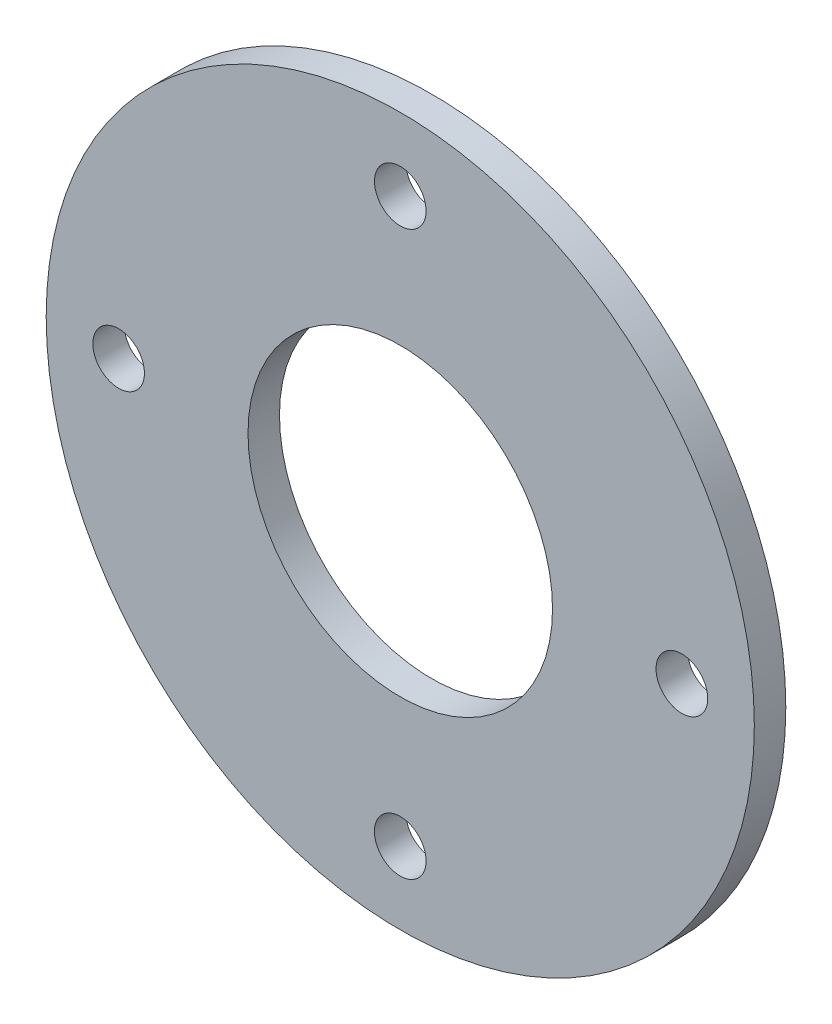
ISO-10303-21;
HEADER;
FILE_DESCRIPTION(('STEP AP214'),'2;1');
FILE_NAME('part.step','',(''),(''),'','','');
FILE_SCHEMA(('AUTOMOTIVE_DESIGN { 1 0 10303 214 1 1 1 1 }'));
ENDSEC;
DATA;
#1=APPLICATION_CONTEXT('core data for automotive mechanical design processes');
#2=APPLICATION_PROTOCOL_DEFINITION('international standard','automotive_design',2000,#1);
#3=PRODUCT_CONTEXT('',#1,'mechanical');
#4=PRODUCT('Part','Part','',(#3));
#5=PRODUCT_RELATED_PRODUCT_CATEGORY('part','',(#4));
#6=PRODUCT_DEFINITION_FORMATION('','',#4);
#7=PRODUCT_DEFINITION_CONTEXT('part definition',#1,'design');
#8=PRODUCT_DEFINITION('design','',#6,#7);
#9=PRODUCT_DEFINITION_SHAPE('','',#8);
#10=(LENGTH_UNIT() NAMED_UNIT(*) SI_UNIT(.MILLI.,.METRE.));
#11=(NAMED_UNIT(*) PLANE_ANGLE_UNIT() SI_UNIT($,.RADIAN.));
#12=(NAMED_UNIT(*) SI_UNIT($,.STERADIAN.) SOLID_ANGLE_UNIT());
#13=UNCERTAINTY_MEASURE_WITH_UNIT(LENGTH_MEASURE(1.E-05),#10,'distance_accuracy_value','');
#14=(GEOMETRIC_REPRESENTATION_CONTEXT(3) GLOBAL_UNCERTAINTY_ASSIGNED_CONTEXT((#13)) GLOBAL_UNIT_ASSIGNED_CONTEXT((#10,
#11,#12)) REPRESENTATION_CONTEXT('',''));
#15=CARTESIAN_POINT('',(0.,0.,0.));
#16=DIRECTION('',(0.,0.,1.));
#17=DIRECTION('',(1.,0.,0.));
#18=AXIS2_PLACEMENT_3D('',#15,#16,#17);
#19=CARTESIAN_POINT('',(0.,0.,10.16));
#20=DIRECTION('',(0.,0.,1.));
#21=DIRECTION('',(1.,0.,0.));
#22=AXIS2_PLACEMENT_3D('',#19,#20,#21);
#23=PLANE('',#22);
#24=CARTESIAN_POINT('',(0.,90.8527596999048,10.16));
#25=DIRECTION('',(0.,0.,-1.));
#26=DIRECTION('',(-1.,0.,0.));
#27=AXIS2_PLACEMENT_3D('',#24,#25,#26);
#28=CIRCLE('',#27,8.33374000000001);
#29=CARTESIAN_POINT('',(-8.33374000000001,90.8527596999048,10.16));
#30=VERTEX_POINT('',#29);
#31=EDGE_CURVE('E64',#30,#30,#28,.T.);
#32=ORIENTED_EDGE('',*,*,#31,.T.);
#33=EDGE_LOOP('',(#32));
#34=FACE_BOUND('',#33,.T.);
#35=CARTESIAN_POINT('',(-90.9113801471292,0.,10.16));
#36=DIRECTION('',(0.,0.,-1.));
#37=DIRECTION('',(-1.,0.,0.));
#38=AXIS2_PLACEMENT_3D('',#35,#36,#37);
#39=CIRCLE('',#38,8.33374000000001);
#40=CARTESIAN_POINT('',(-99.2451201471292,0.,10.16));
#41=VERTEX_POINT('',#40);
#42=EDGE_CURVE('E58',#41,#41,#39,.T.);
#43=ORIENTED_EDGE('',*,*,#42,.T.);
#44=EDGE_LOOP('',(#43));
#45=FACE_BOUND('',#44,.T.);
#46=CARTESIAN_POINT('',(0.,-90.9113801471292,10.16));
#47=DIRECTION('',(0.,0.,-1.));
#48=DIRECTION('',(-1.,0.,0.));
#49=AXIS2_PLACEMENT_3D('',#46,#47,#48);
#50=CIRCLE('',#49,8.33374000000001);
#51=CARTESIAN_POINT('',(-8.33374000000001,-90.9113801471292,10.16));
#52=VERTEX_POINT('',#51);
#53=EDGE_CURVE('E52',#52,#52,#50,.T.);
#54=ORIENTED_EDGE('',*,*,#53,.T.);
#55=EDGE_LOOP('',(#54));
#56=FACE_BOUND('',#55,.T.);
#57=CARTESIAN_POINT('',(90.9113801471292,0.,10.16));
#58=DIRECTION('',(0.,0.,-1.));
#59=DIRECTION('',(-1.,0.,0.));
#60=AXIS2_PLACEMENT_3D('',#57,#58,#59);
#61=CIRCLE('',#60,8.33374000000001);
#62=CARTESIAN_POINT('',(82.5776401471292,0.,10.16));
#63=VERTEX_POINT('',#62);
#64=EDGE_CURVE('E44',#63,#63,#61,.T.);
#65=ORIENTED_EDGE('',*,*,#64,.T.);
#66=EDGE_LOOP('',(#65));
#67=FACE_BOUND('',#66,.T.);
#68=CARTESIAN_POINT('',(0.,0.,10.16));
#69=DIRECTION('',(0.,0.,1.));
#70=DIRECTION('',(1.,0.,0.));
#71=AXIS2_PLACEMENT_3D('',#68,#69,#70);
#72=CIRCLE('',#71,114.3);
#73=CARTESIAN_POINT('',(114.3,0.,10.16));
#74=VERTEX_POINT('',#73);
#75=EDGE_CURVE('E10',#74,#74,#72,.T.);
#76=ORIENTED_EDGE('',*,*,#75,.T.);
#77=EDGE_LOOP('',(#76));
#78=FACE_BOUND('',#77,.T.);
#79=CARTESIAN_POINT('',(0.,0.,10.16));
#80=DIRECTION('',(0.,0.,1.));
#81=DIRECTION('',(1.,0.,0.));
#82=AXIS2_PLACEMENT_3D('',#79,#80,#81);
#83=CIRCLE('',#82,49.1499994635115);
#84=CARTESIAN_POINT('',(49.1499994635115,0.,10.16));
#85=VERTEX_POINT('',#84);
#86=EDGE_CURVE('E39',#85,#85,#83,.T.);
#87=ORIENTED_EDGE('',*,*,#86,.F.);
#88=EDGE_LOOP('',(#87));
#89=FACE_BOUND('',#88,.T.);
#90=ADVANCED_FACE('F28',(#34,#45,#56,#67,#78,#89),#23,.T.);
#91=CARTESIAN_POINT('',(0.,0.,0.));
#92=DIRECTION('',(0.,0.,1.));
#93=DIRECTION('',(1.,0.,0.));
#94=AXIS2_PLACEMENT_3D('',#91,#92,#93);
#95=PLANE('',#94);
#96=CARTESIAN_POINT('',(0.,90.8527596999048,0.));
#97=DIRECTION('',(0.,0.,-1.));
#98=DIRECTION('',(-1.,0.,0.));
#99=AXIS2_PLACEMENT_3D('',#96,#97,#98);
#100=CIRCLE('',#99,8.33374000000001);
#101=CARTESIAN_POINT('',(-8.33374000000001,90.8527596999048,0.));
#102=VERTEX_POINT('',#101);
#103=EDGE_CURVE('E67',#102,#102,#100,.T.);
#104=ORIENTED_EDGE('',*,*,#103,.F.);
#105=EDGE_LOOP('',(#104));
#106=FACE_BOUND('',#105,.T.);
#107=CARTESIAN_POINT('',(-90.9113801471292,0.,0.));
#108=DIRECTION('',(0.,0.,-1.));
#109=DIRECTION('',(-1.,0.,0.));
#110=AXIS2_PLACEMENT_3D('',#107,#108,#109);
#111=CIRCLE('',#110,8.33374000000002);
#112=CARTESIAN_POINT('',(-99.2451201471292,0.,0.));
#113=VERTEX_POINT('',#112);
#114=EDGE_CURVE('E61',#113,#113,#111,.T.);
#115=ORIENTED_EDGE('',*,*,#114,.F.);
#116=EDGE_LOOP('',(#115));
#117=FACE_BOUND('',#116,.T.);
#118=CARTESIAN_POINT('',(0.,-90.9113801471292,0.));
#119=DIRECTION('',(0.,0.,-1.));
#120=DIRECTION('',(-1.,0.,0.));
#121=AXIS2_PLACEMENT_3D('',#118,#119,#120);
#122=CIRCLE('',#121,8.33374000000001);
#123=CARTESIAN_POINT('',(-8.33374000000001,-90.9113801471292,0.));
#124=VERTEX_POINT('',#123);
#125=EDGE_CURVE('E55',#124,#124,#122,.T.);
#126=ORIENTED_EDGE('',*,*,#125,.F.);
#127=EDGE_LOOP('',(#126));
#128=FACE_BOUND('',#127,.T.);
#129=CARTESIAN_POINT('',(90.9113801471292,0.,0.));
#130=DIRECTION('',(0.,0.,-1.));
#131=DIRECTION('',(-1.,0.,0.));
#132=AXIS2_PLACEMENT_3D('',#129,#130,#131);
#133=CIRCLE('',#132,8.33374000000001);
#134=CARTESIAN_POINT('',(82.5776401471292,0.,0.));
#135=VERTEX_POINT('',#134);
#136=EDGE_CURVE('E49',#135,#135,#133,.T.);
#137=ORIENTED_EDGE('',*,*,#136,.F.);
#138=EDGE_LOOP('',(#137));
#139=FACE_BOUND('',#138,.T.);
#140=CARTESIAN_POINT('',(0.,0.,0.));
#141=DIRECTION('',(0.,0.,1.));
#142=DIRECTION('',(1.,0.,0.));
#143=AXIS2_PLACEMENT_3D('',#140,#141,#142);
#144=CIRCLE('',#143,114.3);
#145=CARTESIAN_POINT('',(114.3,0.,0.));
#146=VERTEX_POINT('',#145);
#147=EDGE_CURVE('E32',#146,#146,#144,.T.);
#148=ORIENTED_EDGE('',*,*,#147,.F.);
#149=EDGE_LOOP('',(#148));
#150=FACE_BOUND('',#149,.T.);
#151=CARTESIAN_POINT('',(0.,0.,0.));
#152=DIRECTION('',(0.,0.,1.));
#153=DIRECTION('',(1.,0.,0.));
#154=AXIS2_PLACEMENT_3D('',#151,#152,#153);
#155=CIRCLE('',#154,49.1499994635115);
#156=CARTESIAN_POINT('',(49.1499994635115,0.,0.));
#157=VERTEX_POINT('',#156);
#158=EDGE_CURVE('E41',#157,#157,#155,.T.);
#159=ORIENTED_EDGE('',*,*,#158,.T.);
#160=EDGE_LOOP('',(#159));
#161=FACE_BOUND('',#160,.T.);
#162=ADVANCED_FACE('F73',(#106,#117,#128,#139,#150,#161),#95,.F.);
#163=CARTESIAN_POINT('',(0.,0.,10.16));
#164=DIRECTION('',(0.,0.,-1.));
#165=DIRECTION('',(-1.,0.,0.));
#166=AXIS2_PLACEMENT_3D('',#163,#164,#165);
#167=CYLINDRICAL_SURFACE('',#166,114.3);
#168=ORIENTED_EDGE('',*,*,#75,.F.);
#169=EDGE_LOOP('',(#168));
#170=FACE_BOUND('',#169,.T.);
#171=ORIENTED_EDGE('',*,*,#147,.T.);
#172=EDGE_LOOP('',(#171));
#173=FACE_BOUND('',#172,.T.);
#174=ADVANCED_FACE('F30',(#170,#173),#167,.T.);
#175=CARTESIAN_POINT('',(0.,0.,10.16));
#176=DIRECTION('',(0.,0.,-1.));
#177=DIRECTION('',(-1.,0.,0.));
#178=AXIS2_PLACEMENT_3D('',#175,#176,#177);
#179=CYLINDRICAL_SURFACE('',#178,49.1499994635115);
#180=ORIENTED_EDGE('',*,*,#86,.T.);
#181=EDGE_LOOP('',(#180));
#182=FACE_BOUND('',#181,.T.);
#183=ORIENTED_EDGE('',*,*,#158,.F.);
#184=EDGE_LOOP('',(#183));
#185=FACE_BOUND('',#184,.T.);
#186=ADVANCED_FACE('F86',(#182,#185),#179,.F.);
#187=CARTESIAN_POINT('',(90.9113801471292,0.,0.));
#188=DIRECTION('',(0.,0.,-1.));
#189=DIRECTION('',(-1.,0.,0.));
#190=AXIS2_PLACEMENT_3D('',#187,#188,#189);
#191=CYLINDRICAL_SURFACE('',#190,8.33374000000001);
#192=ORIENTED_EDGE('',*,*,#64,.F.);
#193=EDGE_LOOP('',(#192));
#194=FACE_BOUND('',#193,.T.);
#195=ORIENTED_EDGE('',*,*,#136,.T.);
#196=EDGE_LOOP('',(#195));
#197=FACE_BOUND('',#196,.T.);
#198=ADVANCED_FACE('F88',(#194,#197),#191,.F.);
#199=CARTESIAN_POINT('',(0.,-90.9113801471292,0.));
#200=DIRECTION('',(0.,0.,-1.));
#201=DIRECTION('',(-1.,0.,0.));
#202=AXIS2_PLACEMENT_3D('',#199,#200,#201);
#203=CYLINDRICAL_SURFACE('',#202,8.33374000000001);
#204=ORIENTED_EDGE('',*,*,#53,.F.);
#205=EDGE_LOOP('',(#204));
#206=FACE_BOUND('',#205,.T.);
#207=ORIENTED_EDGE('',*,*,#125,.T.);
#208=EDGE_LOOP('',(#207));
#209=FACE_BOUND('',#208,.T.);
#210=ADVANCED_FACE('F95',(#206,#209),#203,.F.);
#211=CARTESIAN_POINT('',(-90.9113801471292,0.,0.));
#212=DIRECTION('',(0.,0.,-1.));
#213=DIRECTION('',(-1.,0.,0.));
#214=AXIS2_PLACEMENT_3D('',#211,#212,#213);
#215=CYLINDRICAL_SURFACE('',#214,8.33374000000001);
#216=ORIENTED_EDGE('',*,*,#42,.F.);
#217=EDGE_LOOP('',(#216));
#218=FACE_BOUND('',#217,.T.);
#219=ORIENTED_EDGE('',*,*,#114,.T.);
#220=EDGE_LOOP('',(#219));
#221=FACE_BOUND('',#220,.T.);
#222=ADVANCED_FACE('F117',(#218,#221),#215,.F.);
#223=CARTESIAN_POINT('',(0.,90.8527596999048,0.));
#224=DIRECTION('',(0.,0.,-1.));
#225=DIRECTION('',(-1.,0.,0.));
#226=AXIS2_PLACEMENT_3D('',#223,#224,#225);
#227=CYLINDRICAL_SURFACE('',#226,8.33374000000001);
#228=ORIENTED_EDGE('',*,*,#31,.F.);
#229=EDGE_LOOP('',(#228));
#230=FACE_BOUND('',#229,.T.);
#231=ORIENTED_EDGE('',*,*,#103,.T.);
#232=EDGE_LOOP('',(#231));
#233=FACE_BOUND('',#232,.T.);
#234=ADVANCED_FACE('F71',(#230,#233),#227,.F.);
#235=CLOSED_SHELL('',(#90,#162,#174,#186,#198,#210,#222,#234));
#236=MANIFOLD_SOLID_BREP('B2',#235);
#237=ADVANCED_BREP_SHAPE_REPRESENTATION('',(#18,#236),#14);
#238=SHAPE_DEFINITION_REPRESENTATION(#9,#237);
ENDSEC;
END-ISO-10303-21;
